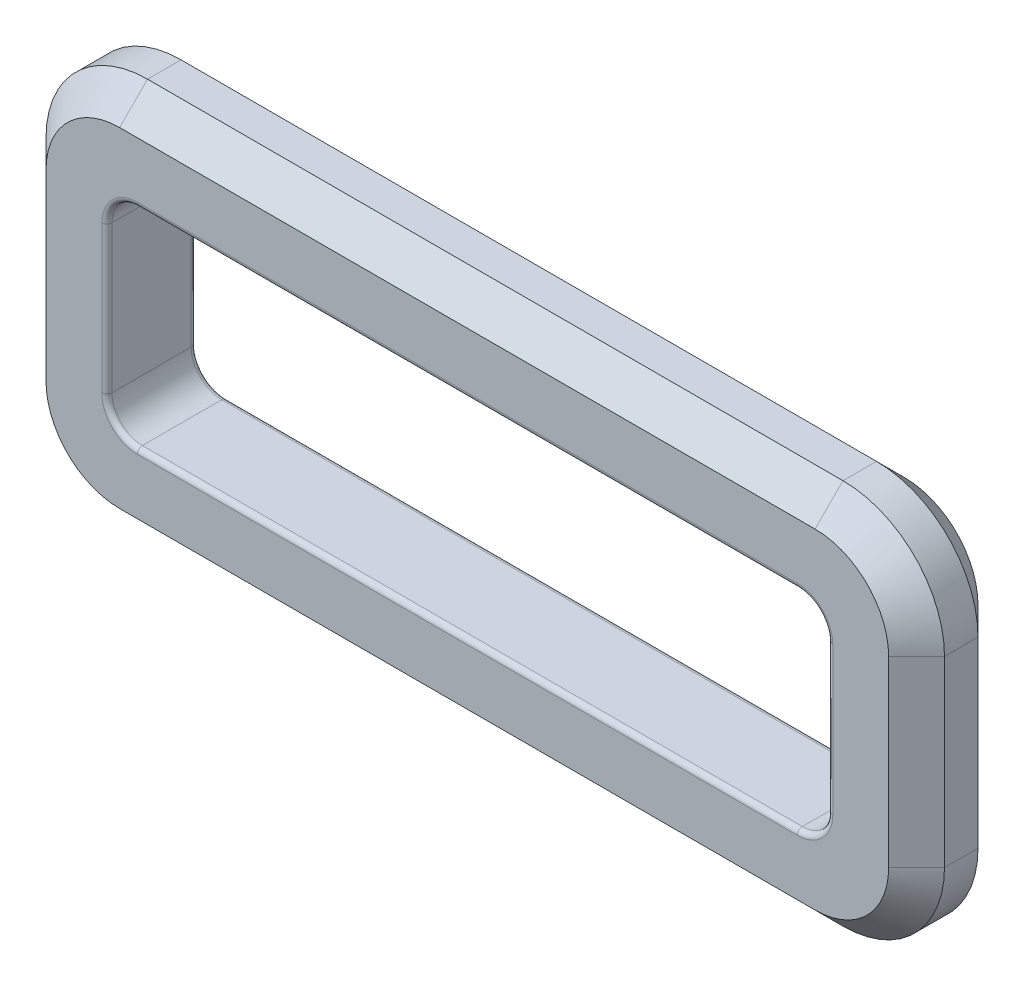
from build123d import *

# Parameters (mm, degrees)
BOSS_EXTRUDE1_DEPTH = 0.88
FILLET1_R           = 0.05
CHAMFER1_SIZE       = 0.275


with BuildPart() as part:
    # Sketch1 → Boss-Extrude1 (new body)
    with BuildSketch(Plane.XY):
        with BuildLine():
            Line((-3.425, -1.9), (3.425, -1.9))
            ThreePointArc((3.425, -1.9), (4.132106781, -1.607106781), (4.425, -0.9))
            Line((4.425, -0.9), (4.425, 0.9))
            ThreePointArc((4.425, 0.9), (4.132106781, 1.607106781), (3.425, 1.9))
            Line((3.425, 1.9), (-3.425, 1.9))
            ThreePointArc((-3.425, 1.9), (-4.132106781, 1.607106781), (-4.425, 0.9))
            Line((-4.425, 0.9), (-4.425, -0.9))
            ThreePointArc((-4.425, -0.9), (-4.132106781, -1.607106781), (-3.425, -1.9))
        make_face()
        with BuildLine():
            Line((-3.25, -1.025), (3.25, -1.025))
            ThreePointArc((3.25, -1.025), (3.462132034, -0.937132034), (3.55, -0.725))
            Line((3.55, -0.725), (3.55, 0.725))
            ThreePointArc((3.55, 0.725), (3.462132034, 0.937132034), (3.25, 1.025))
            Line((3.25, 1.025), (-3.25, 1.025))
            ThreePointArc((-3.25, 1.025), (-3.462132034, 0.937132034), (-3.55, 0.725))
            Line((-3.55, 0.725), (-3.55, -0.725))
            ThreePointArc((-3.55, -0.725), (-3.462132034, -0.937132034), (-3.25, -1.025))
        make_face(mode=Mode.SUBTRACT)
    extrude(amount=BOSS_EXTRUDE1_DEPTH)

    # Fillet1
    fillet1_edges = [part.edges().sort_by_distance(p)[0] for p in [
        (3.462132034, 0.937132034, 0),
        (0, 1.025, 0),
        (-3.462132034, 0.937132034, 0),
        (-3.55, 0, 0),
        (-3.462132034, -0.937132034, 0),
        (0, -1.025, 0),
        (3.462132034, -0.937132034, 0),
        (3.55, 0, 0),
        (3.462132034, 0.937132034, 0.88),
        (0, 1.025, 0.88),
        (-3.462132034, 0.937132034, 0.88),
        (-3.55, 0, 0.88),
        (-3.462132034, -0.937132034, 0.88),
        (0, -1.025, 0.88),
        (3.462132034, -0.937132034, 0.88),
        (3.55, 0, 0.88),
    ]]
    fillet(fillet1_edges, radius=FILLET1_R)

    # Chamfer1
    chamfer1_edges = [part.edges().sort_by_distance(p)[0] for p in [
        (0, 1.9, 0),
        (4.132106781, 1.607106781, 0),
        (4.425, 0, 0),
        (4.132106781, -1.607106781, 0),
        (4.132106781, 1.607106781, 0.88),
        (0, 1.9, 0.88),
        (-4.132106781, 1.607106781, 0.88),
        (-4.425, 0, 0.88),
        (-4.132106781, -1.607106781, 0.88),
        (0, -1.9, 0.88),
        (4.132106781, -1.607106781, 0.88),
        (0, -1.9, 0),
        (4.425, 0, 0.88),
        (-4.132106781, -1.607106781, 0),
        (-4.425, 0, 0),
        (-4.132106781, 1.607106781, 0),
    ]]
    chamfer(chamfer1_edges, length=CHAMFER1_SIZE)


solid = part.part
